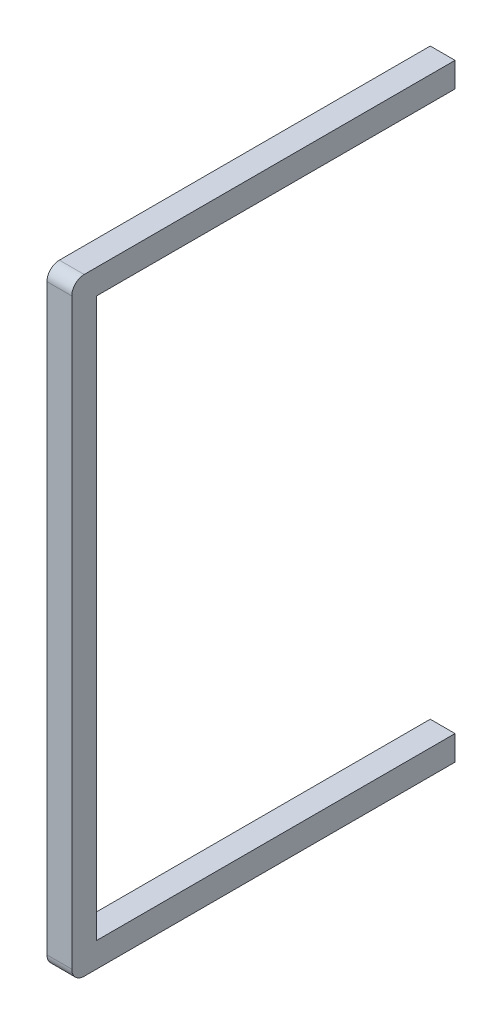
ISO-10303-21;
HEADER;
FILE_DESCRIPTION(('STEP AP214'),'2;1');
FILE_NAME('part.step','',(''),(''),'','','');
FILE_SCHEMA(('AUTOMOTIVE_DESIGN { 1 0 10303 214 1 1 1 1 }'));
ENDSEC;
DATA;
#1=APPLICATION_CONTEXT('core data for automotive mechanical design processes');
#2=APPLICATION_PROTOCOL_DEFINITION('international standard','automotive_design',2000,#1);
#3=PRODUCT_CONTEXT('',#1,'mechanical');
#4=PRODUCT('Part','Part','',(#3));
#5=PRODUCT_RELATED_PRODUCT_CATEGORY('part','',(#4));
#6=PRODUCT_DEFINITION_FORMATION('','',#4);
#7=PRODUCT_DEFINITION_CONTEXT('part definition',#1,'design');
#8=PRODUCT_DEFINITION('design','',#6,#7);
#9=PRODUCT_DEFINITION_SHAPE('','',#8);
#10=(LENGTH_UNIT() NAMED_UNIT(*) SI_UNIT(.MILLI.,.METRE.));
#11=(NAMED_UNIT(*) PLANE_ANGLE_UNIT() SI_UNIT($,.RADIAN.));
#12=(NAMED_UNIT(*) SI_UNIT($,.STERADIAN.) SOLID_ANGLE_UNIT());
#13=UNCERTAINTY_MEASURE_WITH_UNIT(LENGTH_MEASURE(1.E-05),#10,'distance_accuracy_value','');
#14=(GEOMETRIC_REPRESENTATION_CONTEXT(3) GLOBAL_UNCERTAINTY_ASSIGNED_CONTEXT((#13)) GLOBAL_UNIT_ASSIGNED_CONTEXT((#10,
#11,#12)) REPRESENTATION_CONTEXT('',''));
#15=CARTESIAN_POINT('',(0.,0.,0.));
#16=DIRECTION('',(0.,0.,1.));
#17=DIRECTION('',(1.,0.,0.));
#18=AXIS2_PLACEMENT_3D('',#15,#16,#17);
#19=CARTESIAN_POINT('',(0.,0.,0.));
#20=DIRECTION('',(0.,0.,1.));
#21=DIRECTION('',(1.,0.,0.));
#22=AXIS2_PLACEMENT_3D('',#19,#20,#21);
#23=PLANE('',#22);
#24=DIRECTION('',(1.,0.,0.));
#25=VECTOR('',#24,1.);
#26=CARTESIAN_POINT('',(-1518.33715503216,21.1353350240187,0.));
#27=LINE('',#26,#25);
#28=CARTESIAN_POINT('',(-1519.33715503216,21.1353350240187,0.));
#29=VERTEX_POINT('',#28);
#30=CARTESIAN_POINT('',(-1518.33715503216,21.1353350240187,0.));
#31=VERTEX_POINT('',#30);
#32=EDGE_CURVE('E131',#29,#31,#27,.T.);
#33=ORIENTED_EDGE('',*,*,#32,.F.);
#34=DIRECTION('',(0.,-1.,0.));
#35=VECTOR('',#34,1.);
#36=CARTESIAN_POINT('',(-1519.33715503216,44.6353350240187,0.));
#37=LINE('',#36,#35);
#38=CARTESIAN_POINT('',(-1519.33715503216,43.6353350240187,0.));
#39=VERTEX_POINT('',#38);
#40=EDGE_CURVE('E163',#39,#29,#37,.T.);
#41=ORIENTED_EDGE('',*,*,#40,.F.);
#42=DIRECTION('',(-1.,0.,0.));
#43=VECTOR('',#42,1.);
#44=CARTESIAN_POINT('',(-1518.33715503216,43.6353350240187,0.));
#45=LINE('',#44,#43);
#46=CARTESIAN_POINT('',(-1518.33715503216,43.6353350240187,0.));
#47=VERTEX_POINT('',#46);
#48=EDGE_CURVE('E142',#47,#39,#45,.T.);
#49=ORIENTED_EDGE('',*,*,#48,.F.);
#50=DIRECTION('',(0.,1.,0.));
#51=VECTOR('',#50,1.);
#52=CARTESIAN_POINT('',(-1518.33715503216,44.6353350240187,0.));
#53=LINE('',#52,#51);
#54=EDGE_CURVE('E175',#31,#47,#53,.T.);
#55=ORIENTED_EDGE('',*,*,#54,.F.);
#56=EDGE_LOOP('',(#33,#41,#49,#55));
#57=FACE_BOUND('',#56,.T.);
#58=ADVANCED_FACE('F34',(#57),#23,.F.);
#59=CARTESIAN_POINT('',(-1519.33715503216,44.6353350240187,1.));
#60=DIRECTION('',(1.,0.,0.));
#61=DIRECTION('',(0.,0.,-1.));
#62=AXIS2_PLACEMENT_3D('',#59,#60,#61);
#63=PLANE('',#62);
#64=DIRECTION('',(0.,-1.,0.));
#65=VECTOR('',#64,1.);
#66=CARTESIAN_POINT('',(-1519.33715503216,44.6353350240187,1.));
#67=LINE('',#66,#65);
#68=CARTESIAN_POINT('',(-1519.33715503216,44.1353350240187,1.));
#69=VERTEX_POINT('',#68);
#70=CARTESIAN_POINT('',(-1519.33715503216,20.6353350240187,1.));
#71=VERTEX_POINT('',#70);
#72=EDGE_CURVE('E157',#69,#71,#67,.T.);
#73=ORIENTED_EDGE('',*,*,#72,.F.);
#74=CARTESIAN_POINT('',(-1519.33715503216,44.1353350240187,0.5));
#75=DIRECTION('',(1.,0.,0.));
#76=DIRECTION('',(0.,0.,-1.));
#77=AXIS2_PLACEMENT_3D('',#74,#75,#76);
#78=CIRCLE('',#77,0.5);
#79=CARTESIAN_POINT('',(-1519.33715503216,44.6353350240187,0.5));
#80=VERTEX_POINT('',#79);
#81=EDGE_CURVE('E196',#69,#80,#78,.F.);
#82=ORIENTED_EDGE('',*,*,#81,.T.);
#83=DIRECTION('',(0.,0.,-1.));
#84=VECTOR('',#83,1.);
#85=CARTESIAN_POINT('',(-1519.33715503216,44.6353350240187,1.));
#86=LINE('',#85,#84);
#87=CARTESIAN_POINT('',(-1519.33715503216,44.6353350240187,-14.45));
#88=VERTEX_POINT('',#87);
#89=EDGE_CURVE('E183',#80,#88,#86,.T.);
#90=ORIENTED_EDGE('',*,*,#89,.T.);
#91=DIRECTION('',(0.,1.,0.));
#92=VECTOR('',#91,1.);
#93=CARTESIAN_POINT('',(-1519.33715503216,44.6353350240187,-14.45));
#94=LINE('',#93,#92);
#95=CARTESIAN_POINT('',(-1519.33715503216,43.6353350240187,-14.45));
#96=VERTEX_POINT('',#95);
#97=EDGE_CURVE('E148',#96,#88,#94,.T.);
#98=ORIENTED_EDGE('',*,*,#97,.F.);
#99=DIRECTION('',(0.,0.,1.));
#100=VECTOR('',#99,1.);
#101=CARTESIAN_POINT('',(-1519.33715503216,43.6353350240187,-14.45));
#102=LINE('',#101,#100);
#103=EDGE_CURVE('E154',#96,#39,#102,.T.);
#104=ORIENTED_EDGE('',*,*,#103,.T.);
#105=ORIENTED_EDGE('',*,*,#40,.T.);
#106=DIRECTION('',(0.,0.,1.));
#107=VECTOR('',#106,1.);
#108=CARTESIAN_POINT('',(-1519.33715503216,21.1353350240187,-14.45));
#109=LINE('',#108,#107);
#110=CARTESIAN_POINT('',(-1519.33715503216,21.1353350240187,-14.45));
#111=VERTEX_POINT('',#110);
#112=EDGE_CURVE('E140',#111,#29,#109,.T.);
#113=ORIENTED_EDGE('',*,*,#112,.F.);
#114=DIRECTION('',(0.,1.,0.));
#115=VECTOR('',#114,1.);
#116=CARTESIAN_POINT('',(-1519.33715503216,20.1353350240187,-14.45));
#117=LINE('',#116,#115);
#118=CARTESIAN_POINT('',(-1519.33715503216,20.1353350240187,-14.45));
#119=VERTEX_POINT('',#118);
#120=EDGE_CURVE('E125',#119,#111,#117,.T.);
#121=ORIENTED_EDGE('',*,*,#120,.F.);
#122=DIRECTION('',(0.,0.,-1.));
#123=VECTOR('',#122,1.);
#124=CARTESIAN_POINT('',(-1519.33715503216,20.1353350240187,1.));
#125=LINE('',#124,#123);
#126=CARTESIAN_POINT('',(-1519.33715503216,20.1353350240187,0.5));
#127=VERTEX_POINT('',#126);
#128=EDGE_CURVE('E116',#127,#119,#125,.T.);
#129=ORIENTED_EDGE('',*,*,#128,.F.);
#130=CARTESIAN_POINT('',(-1519.33715503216,20.6353350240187,0.5));
#131=DIRECTION('',(1.,0.,0.));
#132=DIRECTION('',(0.,0.,-1.));
#133=AXIS2_PLACEMENT_3D('',#130,#131,#132);
#134=CIRCLE('',#133,0.5);
#135=EDGE_CURVE('E193',#127,#71,#134,.F.);
#136=ORIENTED_EDGE('',*,*,#135,.T.);
#137=EDGE_LOOP('',(#73,#82,#90,#98,#104,#105,#113,#121,#129,#136));
#138=FACE_BOUND('',#137,.T.);
#139=ADVANCED_FACE('F207',(#138),#63,.F.);
#140=CARTESIAN_POINT('',(-1519.33715503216,20.1353350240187,1.));
#141=DIRECTION('',(0.,1.,0.));
#142=DIRECTION('',(0.,0.,1.));
#143=AXIS2_PLACEMENT_3D('',#140,#141,#142);
#144=PLANE('',#143);
#145=DIRECTION('',(0.,0.,-1.));
#146=VECTOR('',#145,1.);
#147=CARTESIAN_POINT('',(-1518.33715503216,20.1353350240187,1.));
#148=LINE('',#147,#146);
#149=CARTESIAN_POINT('',(-1518.33715503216,20.1353350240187,0.5));
#150=VERTEX_POINT('',#149);
#151=CARTESIAN_POINT('',(-1518.33715503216,20.1353350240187,-14.45));
#152=VERTEX_POINT('',#151);
#153=EDGE_CURVE('E109',#150,#152,#148,.T.);
#154=ORIENTED_EDGE('',*,*,#153,.F.);
#155=DIRECTION('',(1.,0.,0.));
#156=VECTOR('',#155,1.);
#157=CARTESIAN_POINT('',(-1519.33715503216,20.1353350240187,0.5));
#158=LINE('',#157,#156);
#159=EDGE_CURVE('E11',#150,#127,#158,.F.);
#160=ORIENTED_EDGE('',*,*,#159,.T.);
#161=ORIENTED_EDGE('',*,*,#128,.T.);
#162=DIRECTION('',(-1.,0.,0.));
#163=VECTOR('',#162,1.);
#164=CARTESIAN_POINT('',(-1518.33715503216,20.1353350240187,-14.45));
#165=LINE('',#164,#163);
#166=EDGE_CURVE('E120',#152,#119,#165,.T.);
#167=ORIENTED_EDGE('',*,*,#166,.F.);
#168=EDGE_LOOP('',(#154,#160,#161,#167));
#169=FACE_BOUND('',#168,.T.);
#170=ADVANCED_FACE('F121',(#169),#144,.F.);
#171=CARTESIAN_POINT('',(-1518.33715503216,44.6353350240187,1.));
#172=DIRECTION('',(-1.,0.,0.));
#173=DIRECTION('',(0.,0.,1.));
#174=AXIS2_PLACEMENT_3D('',#171,#172,#173);
#175=PLANE('',#174);
#176=DIRECTION('',(0.,0.,-1.));
#177=VECTOR('',#176,1.);
#178=CARTESIAN_POINT('',(-1518.33715503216,44.6353350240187,1.));
#179=LINE('',#178,#177);
#180=CARTESIAN_POINT('',(-1518.33715503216,44.6353350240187,0.5));
#181=VERTEX_POINT('',#180);
#182=CARTESIAN_POINT('',(-1518.33715503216,44.6353350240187,-14.45));
#183=VERTEX_POINT('',#182);
#184=EDGE_CURVE('E117',#181,#183,#179,.T.);
#185=ORIENTED_EDGE('',*,*,#184,.F.);
#186=CARTESIAN_POINT('',(-1518.33715503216,44.1353350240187,0.5));
#187=DIRECTION('',(-1.,0.,0.));
#188=DIRECTION('',(0.,0.,1.));
#189=AXIS2_PLACEMENT_3D('',#186,#187,#188);
#190=CIRCLE('',#189,0.5);
#191=CARTESIAN_POINT('',(-1518.33715503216,44.1353350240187,1.));
#192=VERTEX_POINT('',#191);
#193=EDGE_CURVE('E42',#181,#192,#190,.F.);
#194=ORIENTED_EDGE('',*,*,#193,.T.);
#195=DIRECTION('',(0.,1.,0.));
#196=VECTOR('',#195,1.);
#197=CARTESIAN_POINT('',(-1518.33715503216,44.6353350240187,1.));
#198=LINE('',#197,#196);
#199=CARTESIAN_POINT('',(-1518.33715503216,20.6353350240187,1.));
#200=VERTEX_POINT('',#199);
#201=EDGE_CURVE('E185',#200,#192,#198,.T.);
#202=ORIENTED_EDGE('',*,*,#201,.F.);
#203=CARTESIAN_POINT('',(-1518.33715503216,20.6353350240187,0.5));
#204=DIRECTION('',(-1.,0.,0.));
#205=DIRECTION('',(0.,0.,1.));
#206=AXIS2_PLACEMENT_3D('',#203,#204,#205);
#207=CIRCLE('',#206,0.5);
#208=EDGE_CURVE('E49',#200,#150,#207,.F.);
#209=ORIENTED_EDGE('',*,*,#208,.T.);
#210=ORIENTED_EDGE('',*,*,#153,.T.);
#211=DIRECTION('',(0.,-1.,0.));
#212=VECTOR('',#211,1.);
#213=CARTESIAN_POINT('',(-1518.33715503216,20.1353350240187,-14.45));
#214=LINE('',#213,#212);
#215=CARTESIAN_POINT('',(-1518.33715503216,21.1353350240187,-14.45));
#216=VERTEX_POINT('',#215);
#217=EDGE_CURVE('E113',#216,#152,#214,.T.);
#218=ORIENTED_EDGE('',*,*,#217,.F.);
#219=DIRECTION('',(0.,0.,1.));
#220=VECTOR('',#219,1.);
#221=CARTESIAN_POINT('',(-1518.33715503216,21.1353350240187,-14.45));
#222=LINE('',#221,#220);
#223=EDGE_CURVE('E137',#216,#31,#222,.T.);
#224=ORIENTED_EDGE('',*,*,#223,.T.);
#225=ORIENTED_EDGE('',*,*,#54,.T.);
#226=DIRECTION('',(0.,0.,1.));
#227=VECTOR('',#226,1.);
#228=CARTESIAN_POINT('',(-1518.33715503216,43.6353350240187,-14.45));
#229=LINE('',#228,#227);
#230=CARTESIAN_POINT('',(-1518.33715503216,43.6353350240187,-14.45));
#231=VERTEX_POINT('',#230);
#232=EDGE_CURVE('E168',#231,#47,#229,.T.);
#233=ORIENTED_EDGE('',*,*,#232,.F.);
#234=DIRECTION('',(0.,-1.,0.));
#235=VECTOR('',#234,1.);
#236=CARTESIAN_POINT('',(-1518.33715503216,44.6353350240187,-14.45));
#237=LINE('',#236,#235);
#238=EDGE_CURVE('E143',#183,#231,#237,.T.);
#239=ORIENTED_EDGE('',*,*,#238,.F.);
#240=EDGE_LOOP('',(#185,#194,#202,#209,#210,#218,#224,#225,#233,#239));
#241=FACE_BOUND('',#240,.T.);
#242=ADVANCED_FACE('F111',(#241),#175,.F.);
#243=CARTESIAN_POINT('',(-1519.33715503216,44.6353350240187,1.));
#244=DIRECTION('',(0.,-1.,0.));
#245=DIRECTION('',(0.,0.,-1.));
#246=AXIS2_PLACEMENT_3D('',#243,#244,#245);
#247=PLANE('',#246);
#248=ORIENTED_EDGE('',*,*,#89,.F.);
#249=DIRECTION('',(-1.,0.,0.));
#250=VECTOR('',#249,1.);
#251=CARTESIAN_POINT('',(-1518.33715503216,44.6353350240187,0.5));
#252=LINE('',#251,#250);
#253=EDGE_CURVE('E57',#80,#181,#252,.F.);
#254=ORIENTED_EDGE('',*,*,#253,.T.);
#255=ORIENTED_EDGE('',*,*,#184,.T.);
#256=DIRECTION('',(1.,0.,0.));
#257=VECTOR('',#256,1.);
#258=CARTESIAN_POINT('',(-1518.33715503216,44.6353350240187,-14.45));
#259=LINE('',#258,#257);
#260=EDGE_CURVE('E151',#88,#183,#259,.T.);
#261=ORIENTED_EDGE('',*,*,#260,.F.);
#262=EDGE_LOOP('',(#248,#254,#255,#261));
#263=FACE_BOUND('',#262,.T.);
#264=ADVANCED_FACE('F210',(#263),#247,.F.);
#265=CARTESIAN_POINT('',(0.,0.,1.));
#266=DIRECTION('',(0.,0.,1.));
#267=DIRECTION('',(1.,0.,0.));
#268=AXIS2_PLACEMENT_3D('',#265,#266,#267);
#269=PLANE('',#268);
#270=ORIENTED_EDGE('',*,*,#201,.T.);
#271=DIRECTION('',(-1.,0.,0.));
#272=VECTOR('',#271,1.);
#273=CARTESIAN_POINT('',(-1519.33715503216,44.1353350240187,1.));
#274=LINE('',#273,#272);
#275=EDGE_CURVE('E187',#192,#69,#274,.T.);
#276=ORIENTED_EDGE('',*,*,#275,.T.);
#277=ORIENTED_EDGE('',*,*,#72,.T.);
#278=DIRECTION('',(1.,0.,0.));
#279=VECTOR('',#278,1.);
#280=CARTESIAN_POINT('',(-1518.33715503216,20.6353350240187,1.));
#281=LINE('',#280,#279);
#282=EDGE_CURVE('E178',#71,#200,#281,.T.);
#283=ORIENTED_EDGE('',*,*,#282,.T.);
#284=EDGE_LOOP('',(#270,#276,#277,#283));
#285=FACE_BOUND('',#284,.T.);
#286=ADVANCED_FACE('F204',(#285),#269,.T.);
#287=CARTESIAN_POINT('',(-1518.33715503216,43.6353350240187,-14.45));
#288=DIRECTION('',(0.,1.,0.));
#289=DIRECTION('',(0.,0.,1.));
#290=AXIS2_PLACEMENT_3D('',#287,#288,#289);
#291=PLANE('',#290);
#292=ORIENTED_EDGE('',*,*,#48,.T.);
#293=ORIENTED_EDGE('',*,*,#103,.F.);
#294=DIRECTION('',(-1.,0.,0.));
#295=VECTOR('',#294,1.);
#296=CARTESIAN_POINT('',(-1518.33715503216,43.6353350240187,-14.45));
#297=LINE('',#296,#295);
#298=EDGE_CURVE('E146',#231,#96,#297,.T.);
#299=ORIENTED_EDGE('',*,*,#298,.F.);
#300=ORIENTED_EDGE('',*,*,#232,.T.);
#301=EDGE_LOOP('',(#292,#293,#299,#300));
#302=FACE_BOUND('',#301,.T.);
#303=ADVANCED_FACE('F217',(#302),#291,.F.);
#304=CARTESIAN_POINT('',(0.,0.,-14.45));
#305=DIRECTION('',(0.,0.,-1.));
#306=DIRECTION('',(-1.,0.,0.));
#307=AXIS2_PLACEMENT_3D('',#304,#305,#306);
#308=PLANE('',#307);
#309=ORIENTED_EDGE('',*,*,#238,.T.);
#310=ORIENTED_EDGE('',*,*,#298,.T.);
#311=ORIENTED_EDGE('',*,*,#97,.T.);
#312=ORIENTED_EDGE('',*,*,#260,.T.);
#313=EDGE_LOOP('',(#309,#310,#311,#312));
#314=FACE_BOUND('',#313,.T.);
#315=ADVANCED_FACE('F212',(#314),#308,.T.);
#316=CARTESIAN_POINT('',(-1518.33715503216,21.1353350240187,-14.45));
#317=DIRECTION('',(0.,-1.,0.));
#318=DIRECTION('',(0.,0.,-1.));
#319=AXIS2_PLACEMENT_3D('',#316,#317,#318);
#320=PLANE('',#319);
#321=ORIENTED_EDGE('',*,*,#32,.T.);
#322=ORIENTED_EDGE('',*,*,#223,.F.);
#323=DIRECTION('',(1.,0.,0.));
#324=VECTOR('',#323,1.);
#325=CARTESIAN_POINT('',(-1518.33715503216,21.1353350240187,-14.45));
#326=LINE('',#325,#324);
#327=EDGE_CURVE('E129',#111,#216,#326,.T.);
#328=ORIENTED_EDGE('',*,*,#327,.F.);
#329=ORIENTED_EDGE('',*,*,#112,.T.);
#330=EDGE_LOOP('',(#321,#322,#328,#329));
#331=FACE_BOUND('',#330,.T.);
#332=ADVANCED_FACE('F224',(#331),#320,.F.);
#333=CARTESIAN_POINT('',(0.,0.,-14.45));
#334=DIRECTION('',(0.,0.,1.));
#335=DIRECTION('',(1.,0.,0.));
#336=AXIS2_PLACEMENT_3D('',#333,#334,#335);
#337=PLANE('',#336);
#338=ORIENTED_EDGE('',*,*,#217,.T.);
#339=ORIENTED_EDGE('',*,*,#166,.T.);
#340=ORIENTED_EDGE('',*,*,#120,.T.);
#341=ORIENTED_EDGE('',*,*,#327,.T.);
#342=EDGE_LOOP('',(#338,#339,#340,#341));
#343=FACE_BOUND('',#342,.T.);
#344=ADVANCED_FACE('F127',(#343),#337,.F.);
#345=CARTESIAN_POINT('',(0.,44.1353350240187,0.5));
#346=DIRECTION('',(1.,0.,0.));
#347=DIRECTION('',(0.,0.,-1.));
#348=AXIS2_PLACEMENT_3D('',#345,#346,#347);
#349=CYLINDRICAL_SURFACE('',#348,0.5);
#350=ORIENTED_EDGE('',*,*,#193,.F.);
#351=ORIENTED_EDGE('',*,*,#253,.F.);
#352=ORIENTED_EDGE('',*,*,#81,.F.);
#353=ORIENTED_EDGE('',*,*,#275,.F.);
#354=EDGE_LOOP('',(#350,#351,#352,#353));
#355=FACE_BOUND('',#354,.T.);
#356=ADVANCED_FACE('F205',(#355),#349,.T.);
#357=CARTESIAN_POINT('',(0.,20.6353350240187,0.5));
#358=DIRECTION('',(-1.,0.,0.));
#359=DIRECTION('',(0.,0.,1.));
#360=AXIS2_PLACEMENT_3D('',#357,#358,#359);
#361=CYLINDRICAL_SURFACE('',#360,0.5);
#362=ORIENTED_EDGE('',*,*,#135,.F.);
#363=ORIENTED_EDGE('',*,*,#159,.F.);
#364=ORIENTED_EDGE('',*,*,#208,.F.);
#365=ORIENTED_EDGE('',*,*,#282,.F.);
#366=EDGE_LOOP('',(#362,#363,#364,#365));
#367=FACE_BOUND('',#366,.T.);
#368=ADVANCED_FACE('F36',(#367),#361,.T.);
#369=CLOSED_SHELL('',(#58,#139,#170,#242,#264,#286,#303,#315,#332,#344,#356,#368));
#370=MANIFOLD_SOLID_BREP('B2',#369);
#371=ADVANCED_BREP_SHAPE_REPRESENTATION('',(#18,#370),#14);
#372=SHAPE_DEFINITION_REPRESENTATION(#9,#371);
ENDSEC;
END-ISO-10303-21;
